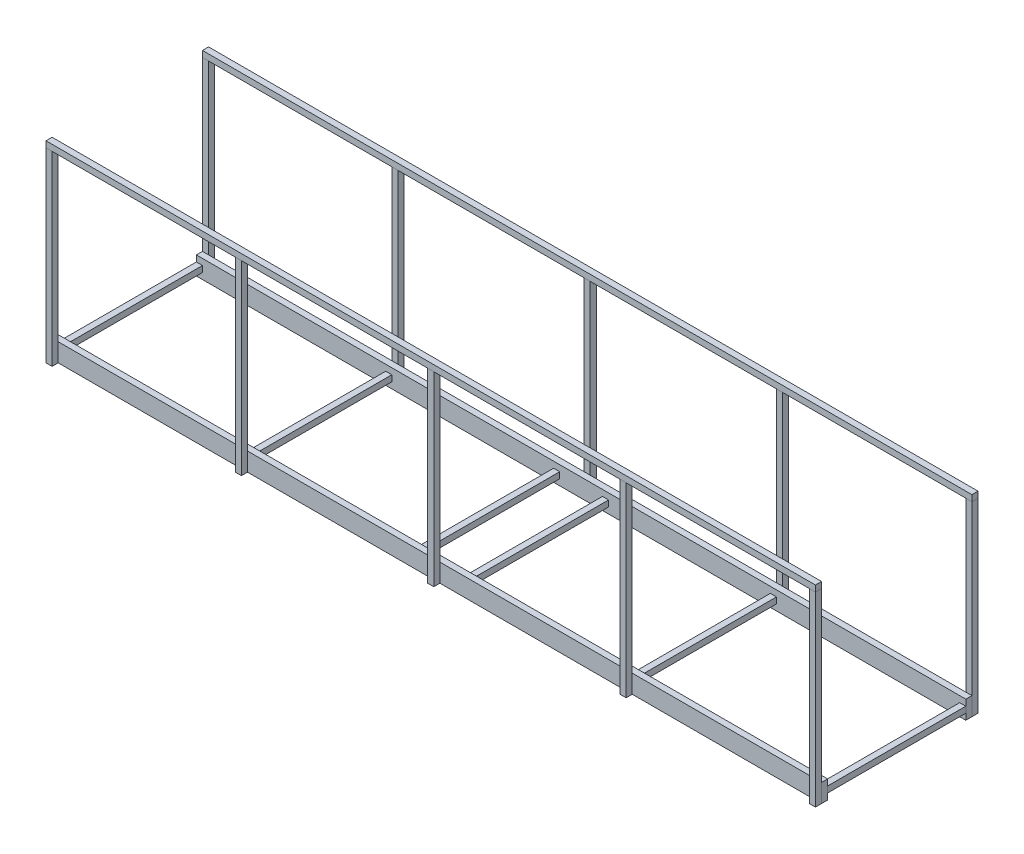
from build123d import *

# Parameters (mm, degrees)
SKETCH12_W                  = 3.175
SKETCH12_H                  = 9.525
STRUCTURAL_MEMBER1_DEPTH    = 400
SKETCH12_ON_SEGMENT_2_W     = 3.175
SKETCH12_ON_SEGMENT_2_H     = 9.525
STRUCTURAL_MEMBER1_2_DEPTH  = 400
SKETCH14_W                  = 3.175
SKETCH14_H                  = 3.175
STRUCTURAL_MEMBER2_DEPTH    = 75
SKETCH15_W                  = 3.175
SKETCH15_H                  = 3.175
STRUCTURAL_MEMBER3_DEPTH    = 75
SKETCH16_W                  = 3.175
SKETCH16_H                  = 3.175
STRUCTURAL_MEMBER4_DEPTH    = 75
SKETCH16_ON_SEGMENT_2_W     = 3.175
SKETCH16_ON_SEGMENT_2_H     = 3.175
STRUCTURAL_MEMBER4_2_DEPTH  = 75
SKETCH16_ON_SEGMENT_3_W     = 3.175
SKETCH16_ON_SEGMENT_3_H     = 3.175
STRUCTURAL_MEMBER4_3_DEPTH  = 75
SKETCH16_ON_SEGMENT_4_W     = 3.175
SKETCH16_ON_SEGMENT_4_H     = 3.175
STRUCTURAL_MEMBER4_4_DEPTH  = 75
SKETCH17_W                  = 3.175
SKETCH17_H                  = 3.175
STRUCTURAL_MEMBER5_DEPTH    = 100
SKETCH19_W                  = 3.175
SKETCH19_H                  = 3.175
STRUCTURAL_MEMBER6_DEPTH    = 100
SKETCH110_W                 = 3.175
SKETCH110_H                 = 3.175
STRUCTURAL_MEMBER7_DEPTH    = 100
SKETCH110_ON_SEGMENT_2_W    = 3.175
SKETCH110_ON_SEGMENT_2_H    = 3.175
STRUCTURAL_MEMBER7_2_DEPTH  = 100
SKETCH110_ON_SEGMENT_3_W    = 3.175
SKETCH110_ON_SEGMENT_3_H    = 3.175
STRUCTURAL_MEMBER7_3_DEPTH  = 100
SKETCH111_W                 = 3.175
SKETCH111_H                 = 3.175
STRUCTURAL_MEMBER8_DEPTH    = 400
SKETCH125_W                 = 3.175
SKETCH125_H                 = 3.175
STRUCTURAL_MEMBER15_DEPTH   = 100
SKETCH126_W                 = 3.175
SKETCH126_H                 = 3.175
STRUCTURAL_MEMBER16_DEPTH   = 100
SKETCH127_W                 = 3.175
SKETCH127_H                 = 3.175
STRUCTURAL_MEMBER17_DEPTH   = 100
SKETCH127_ON_SEGMENT_2_W    = 3.175
SKETCH127_ON_SEGMENT_2_H    = 3.175
STRUCTURAL_MEMBER17_2_DEPTH = 100
SKETCH127_ON_SEGMENT_3_W    = 3.175
SKETCH127_ON_SEGMENT_3_H    = 3.175
STRUCTURAL_MEMBER17_3_DEPTH = 100
SKETCH128_W                 = 3.175
SKETCH128_H                 = 3.175
STRUCTURAL_MEMBER18_DEPTH   = 400


with BuildPart() as part:
    # Sketch12 → Structural Member1 (new body)
    with BuildSketch(Plane(origin=(-200, 0, 37.5), x_dir=(0, 0, -1), z_dir=(1, 0, 0))):
        Rectangle(SKETCH12_W, SKETCH12_H)
    extrude(amount=STRUCTURAL_MEMBER1_DEPTH)


with BuildPart() as body_2:
    # Sketch12 on segment 2 (on carried to segment 2) → Structural Member1 2 (new body)
    with BuildSketch(Plane(origin=(-200, 0, -37.5), x_dir=(0, 0, -1), z_dir=(1, 0, 0))):
        Rectangle(SKETCH12_ON_SEGMENT_2_W, SKETCH12_ON_SEGMENT_2_H)
    extrude(amount=STRUCTURAL_MEMBER1_2_DEPTH)


with BuildPart() as body_3:
    # Sketch14 → Structural Member2 (new body)
    with BuildSketch(Plane(origin=(198.4125, 0, 37.5), x_dir=(-1, 0, 0), z_dir=(0, 0, -1))):
        Rectangle(SKETCH14_W, SKETCH14_H)
    extrude(amount=STRUCTURAL_MEMBER2_DEPTH)

    # Trim_Extend1 17: cut part
    add(part.part, mode=Mode.SUBTRACT)

    # Trim_Extend1 20
    split(bisect_by=Plane(origin=(0, 0, -35.9125), x_dir=(0, -1, 0), z_dir=(0, 0, 1)), keep=Keep.TOP)


with BuildPart() as body_4:
    # Sketch15 → Structural Member3 (new body)
    with BuildSketch(Plane(origin=(-198.4125, 0, 37.5), x_dir=(-1, 0, 0), z_dir=(0, 0, -1))):
        Rectangle(SKETCH15_W, SKETCH15_H)
    extrude(amount=STRUCTURAL_MEMBER3_DEPTH)

    # Trim_Extend1 17: cut part
    add(part.part, mode=Mode.SUBTRACT)

    # Trim_Extend1 34: cut body 2
    add(body_2.part, mode=Mode.SUBTRACT)


with BuildPart() as body_5:
    # Sketch16 → Structural Member4 (new body)
    with BuildSketch(Plane(origin=(-100, 0, -37.5), x_dir=(1, 0, 0), z_dir=(0, 0, 1))):
        Rectangle(SKETCH16_W, SKETCH16_H)
    extrude(amount=STRUCTURAL_MEMBER4_DEPTH)

    # Trim_Extend1
    split(bisect_by=Plane.YX.offset(-35.9125), keep=Keep.TOP)

    # Trim_Extend1 20
    split(bisect_by=Plane(origin=(0, 0, -35.9125), x_dir=(0, -1, 0), z_dir=(0, 0, 1)), keep=Keep.TOP)


with BuildPart() as body_6:
    # Sketch16 on segment 2 (on carried to segment 2) → Structural Member4 2 (new body)
    with BuildSketch(Plane(origin=(-12.7, 0, -37.5), x_dir=(1, 0, 0), z_dir=(0, 0, 1))):
        Rectangle(SKETCH16_ON_SEGMENT_2_W, SKETCH16_ON_SEGMENT_2_H)
    extrude(amount=STRUCTURAL_MEMBER4_2_DEPTH)

    # Trim_Extend1 17: cut part
    add(part.part, mode=Mode.SUBTRACT)

    # Trim_Extend1 34: cut body 2
    add(body_2.part, mode=Mode.SUBTRACT)


with BuildPart() as body_7:
    # Sketch16 on segment 3 (on carried to segment 3) → Structural Member4 3 (new body)
    with BuildSketch(Plane(origin=(12.7, 0, -37.5), x_dir=(1, 0, 0), z_dir=(0, 0, 1))):
        Rectangle(SKETCH16_ON_SEGMENT_3_W, SKETCH16_ON_SEGMENT_3_H)
    extrude(amount=STRUCTURAL_MEMBER4_3_DEPTH)

    # Trim_Extend1 17: cut part
    add(part.part, mode=Mode.SUBTRACT)

    # Trim_Extend1 34: cut body 2
    add(body_2.part, mode=Mode.SUBTRACT)


with BuildPart() as body_8:
    # Sketch16 on segment 4 (on carried to segment 4) → Structural Member4 4 (new body)
    with BuildSketch(Plane(origin=(100, 0, -37.5), x_dir=(1, 0, 0), z_dir=(0, 0, 1))):
        Rectangle(SKETCH16_ON_SEGMENT_4_W, SKETCH16_ON_SEGMENT_4_H)
    extrude(amount=STRUCTURAL_MEMBER4_4_DEPTH)

    # Trim_Extend1
    split(bisect_by=Plane.YX.offset(-35.9125), keep=Keep.TOP)

    # Trim_Extend1 20
    split(bisect_by=Plane(origin=(0, 0, -35.9125), x_dir=(0, -1, 0), z_dir=(0, 0, 1)), keep=Keep.TOP)


with BuildPart() as body_9:
    # Sketch17 → Structural Member5 (new body)
    with BuildSketch(Plane(origin=(-198.4125, -4.7625, 40.675), x_dir=(-1, 0, 0), z_dir=(0, 1, 0))):
        Rectangle(SKETCH17_W, SKETCH17_H)
    extrude(amount=STRUCTURAL_MEMBER5_DEPTH)


with BuildPart() as body_10:
    # Sketch19 → Structural Member6 (new body)
    with BuildSketch(Plane(origin=(198.4125, -4.7625, 40.675), x_dir=(-1, 0, 0), z_dir=(0, 1, 0))):
        Rectangle(SKETCH19_W, SKETCH19_H)
    extrude(amount=STRUCTURAL_MEMBER6_DEPTH)


with BuildPart() as body_11:
    # Sketch110 → Structural Member7 (new body)
    with BuildSketch(Plane(origin=(100, 95.2375, 40.675), x_dir=(1, 0, 0), z_dir=(0, -1, 0))):
        Rectangle(SKETCH110_W, SKETCH110_H)
    extrude(amount=STRUCTURAL_MEMBER7_DEPTH)

    # Trim_Extend2 7
    split(bisect_by=Plane(origin=(0, 92.0625, 40.675), x_dir=(1, 0, 0), z_dir=(0, -1, 0)), keep=Keep.TOP)


with BuildPart() as body_12:
    # Sketch110 on segment 2 (on carried to segment 2) → Structural Member7 2 (new body)
    with BuildSketch(Plane(origin=(0, 95.2375, 40.675), x_dir=(1, 0, 0), z_dir=(0, -1, 0))):
        Rectangle(SKETCH110_ON_SEGMENT_2_W, SKETCH110_ON_SEGMENT_2_H)
    extrude(amount=STRUCTURAL_MEMBER7_2_DEPTH)

    # Trim_Extend2 7
    split(bisect_by=Plane(origin=(0, 92.0625, 40.675), x_dir=(1, 0, 0), z_dir=(0, -1, 0)), keep=Keep.TOP)


with BuildPart() as body_13:
    # Sketch110 on segment 3 (on carried to segment 3) → Structural Member7 3 (new body)
    with BuildSketch(Plane(origin=(-100, 95.2375, 40.675), x_dir=(1, 0, 0), z_dir=(0, -1, 0))):
        Rectangle(SKETCH110_ON_SEGMENT_3_W, SKETCH110_ON_SEGMENT_3_H)
    extrude(amount=STRUCTURAL_MEMBER7_3_DEPTH)


with BuildPart() as body_14:
    # Sketch111 → Structural Member8 (new body)
    with BuildSketch(Plane(origin=(-200, 93.65, 40.675), x_dir=(0, 1, 0), z_dir=(1, 0, 0))):
        Rectangle(SKETCH111_W, SKETCH111_H)
    extrude(amount=STRUCTURAL_MEMBER8_DEPTH)


with BuildPart() as body_9_1:
    add(body_9.part)

    # Trim_Extend2 17: cut body 14
    add(body_14.part, mode=Mode.SUBTRACT)


with BuildPart() as body_13_1:
    add(body_13.part)

    # Trim_Extend2 17: cut body 14
    add(body_14.part, mode=Mode.SUBTRACT)


with BuildPart() as body_10_1:
    add(body_10.part)

    # Trim_Extend2 17: cut body 14
    add(body_14.part, mode=Mode.SUBTRACT)


with BuildPart() as body_15:
    # Sketch125 → Structural Member15 (new body)
    with BuildSketch(Plane(origin=(198.4125, -4.7625, -40.675), x_dir=(1, 0, 0), z_dir=(0, 1, 0))):
        Rectangle(SKETCH125_W, SKETCH125_H)
    extrude(amount=STRUCTURAL_MEMBER15_DEPTH)

    # Trim_Extend3 5
    split(bisect_by=Plane(origin=(0, 92.0625, -40.675), x_dir=(1, 0, 0), z_dir=(0, -1, 0)), keep=Keep.TOP)


with BuildPart() as body_16:
    # Sketch126 → Structural Member16 (new body)
    with BuildSketch(Plane(origin=(-198.4125, -4.7625, -40.675), x_dir=(1, 0, 0), z_dir=(0, 1, 0))):
        Rectangle(SKETCH126_W, SKETCH126_H)
    extrude(amount=STRUCTURAL_MEMBER16_DEPTH)


with BuildPart() as body_17:
    # Sketch127 → Structural Member17 (new body)
    with BuildSketch(Plane(origin=(100, -4.7625, -40.675), x_dir=(1, 0, 0), z_dir=(0, 1, 0))):
        Rectangle(SKETCH127_W, SKETCH127_H)
    extrude(amount=STRUCTURAL_MEMBER17_DEPTH)


with BuildPart() as body_18:
    # Sketch127 on segment 2 (on carried to segment 2) → Structural Member17 2 (new body)
    with BuildSketch(Plane(origin=(0, -4.7625, -40.675), x_dir=(1, 0, 0), z_dir=(0, 1, 0))):
        Rectangle(SKETCH127_ON_SEGMENT_2_W, SKETCH127_ON_SEGMENT_2_H)
    extrude(amount=STRUCTURAL_MEMBER17_2_DEPTH)

    # Trim_Extend3 5
    split(bisect_by=Plane(origin=(0, 92.0625, -40.675), x_dir=(1, 0, 0), z_dir=(0, -1, 0)), keep=Keep.TOP)


with BuildPart() as body_19:
    # Sketch127 on segment 3 (on carried to segment 3) → Structural Member17 3 (new body)
    with BuildSketch(Plane(origin=(-100, -4.7625, -40.675), x_dir=(1, 0, 0), z_dir=(0, 1, 0))):
        Rectangle(SKETCH127_ON_SEGMENT_3_W, SKETCH127_ON_SEGMENT_3_H)
    extrude(amount=STRUCTURAL_MEMBER17_3_DEPTH)

    # Trim_Extend3 5
    split(bisect_by=Plane(origin=(0, 92.0625, -40.675), x_dir=(1, 0, 0), z_dir=(0, -1, 0)), keep=Keep.TOP)


with BuildPart() as body_20:
    # Sketch128 → Structural Member18 (new body)
    with BuildSketch(Plane(origin=(-200, 93.65, -40.675), x_dir=(0, -1, 0), z_dir=(1, 0, 0))):
        Rectangle(SKETCH128_W, SKETCH128_H)
    extrude(amount=STRUCTURAL_MEMBER18_DEPTH)


with BuildPart() as body_17_1:
    add(body_17.part)

    # Trim_Extend3 17: cut body 20
    add(body_20.part, mode=Mode.SUBTRACT)


with BuildPart() as body_16_1:
    add(body_16.part)

    # Trim_Extend3 17: cut body 20
    add(body_20.part, mode=Mode.SUBTRACT)


solid = Compound([part.part, body_2.part, body_3.part, body_4.part, body_5.part, body_6.part, body_7.part, body_8.part, body_11.part, body_12.part, body_14.part, body_9_1.part, body_13_1.part, body_10_1.part, body_15.part, body_18.part, body_19.part, body_20.part, body_17_1.part, body_16_1.part])
